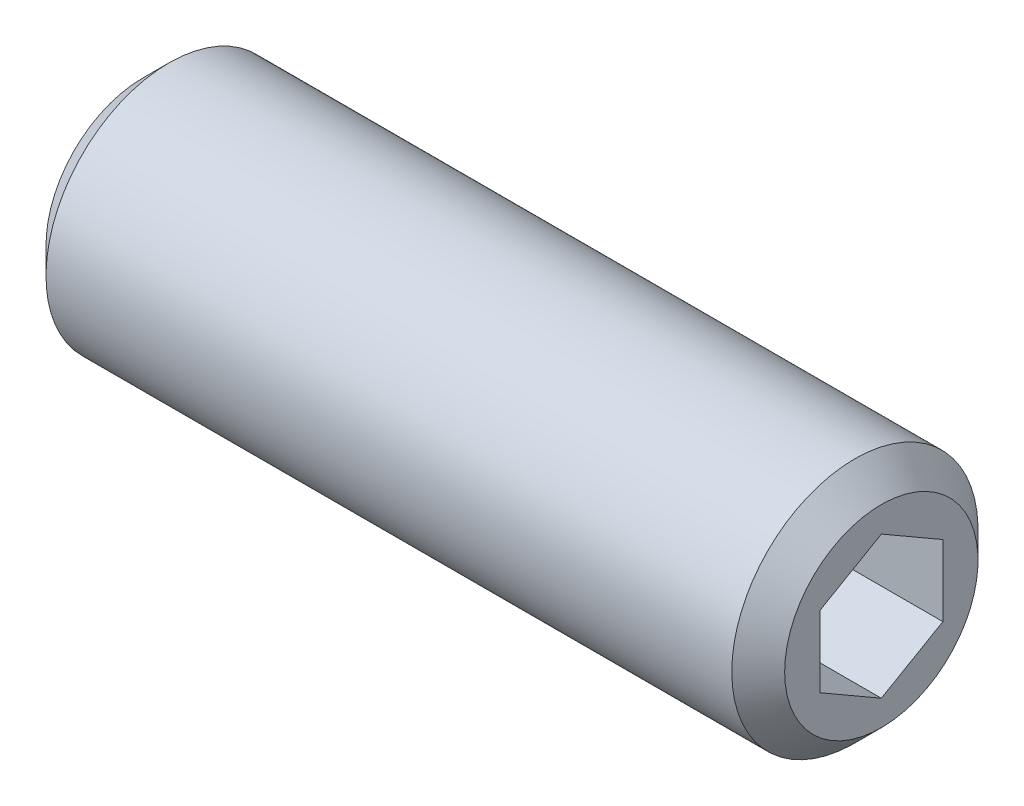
ISO-10303-21;
HEADER;
FILE_DESCRIPTION(('STEP AP214'),'2;1');
FILE_NAME('part.step','',(''),(''),'','','');
FILE_SCHEMA(('AUTOMOTIVE_DESIGN { 1 0 10303 214 1 1 1 1 }'));
ENDSEC;
DATA;
#1=APPLICATION_CONTEXT('core data for automotive mechanical design processes');
#2=APPLICATION_PROTOCOL_DEFINITION('international standard','automotive_design',2000,#1);
#3=PRODUCT_CONTEXT('',#1,'mechanical');
#4=PRODUCT('Part','Part','',(#3));
#5=PRODUCT_RELATED_PRODUCT_CATEGORY('part','',(#4));
#6=PRODUCT_DEFINITION_FORMATION('','',#4);
#7=PRODUCT_DEFINITION_CONTEXT('part definition',#1,'design');
#8=PRODUCT_DEFINITION('design','',#6,#7);
#9=PRODUCT_DEFINITION_SHAPE('','',#8);
#10=(LENGTH_UNIT() NAMED_UNIT(*) SI_UNIT(.MILLI.,.METRE.));
#11=(NAMED_UNIT(*) PLANE_ANGLE_UNIT() SI_UNIT($,.RADIAN.));
#12=(NAMED_UNIT(*) SI_UNIT($,.STERADIAN.) SOLID_ANGLE_UNIT());
#13=UNCERTAINTY_MEASURE_WITH_UNIT(LENGTH_MEASURE(1.E-05),#10,'distance_accuracy_value','');
#14=(GEOMETRIC_REPRESENTATION_CONTEXT(3) GLOBAL_UNCERTAINTY_ASSIGNED_CONTEXT((#13)) GLOBAL_UNIT_ASSIGNED_CONTEXT((#10,
#11,#12)) REPRESENTATION_CONTEXT('',''));
#15=CARTESIAN_POINT('',(0.,0.,0.));
#16=DIRECTION('',(0.,0.,1.));
#17=DIRECTION('',(1.,0.,0.));
#18=AXIS2_PLACEMENT_3D('',#15,#16,#17);
#19=CARTESIAN_POINT('',(12.,-0.577350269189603,-1.00000000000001));
#20=DIRECTION('',(0.,0.,-1.));
#21=DIRECTION('',(-1.,0.,0.));
#22=AXIS2_PLACEMENT_3D('',#19,#20,#21);
#23=PLANE('',#22);
#24=DIRECTION('',(1.,0.,0.));
#25=VECTOR('',#24,1.);
#26=CARTESIAN_POINT('',(12.,-0.577350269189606,-1.00000000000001));
#27=LINE('',#26,#25);
#28=CARTESIAN_POINT('',(9.50000000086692,-0.577350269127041,-0.999999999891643));
#29=VERTEX_POINT('',#28);
#30=CARTESIAN_POINT('',(12.,-0.577350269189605,-1.00000000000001));
#31=VERTEX_POINT('',#30);
#32=EDGE_CURVE('E76',#29,#31,#27,.T.);
#33=ORIENTED_EDGE('',*,*,#32,.T.);
#34=DIRECTION('',(0.,1.,0.));
#35=VECTOR('',#34,1.);
#36=CARTESIAN_POINT('',(12.,-0.577350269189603,-1.00000000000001));
#37=LINE('',#36,#35);
#38=CARTESIAN_POINT('',(12.,0.577350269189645,-0.999999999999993));
#39=VERTEX_POINT('',#38);
#40=EDGE_CURVE('E82',#39,#31,#37,.F.);
#41=ORIENTED_EDGE('',*,*,#40,.F.);
#42=DIRECTION('',(1.,0.,0.));
#43=VECTOR('',#42,1.);
#44=CARTESIAN_POINT('',(12.,0.577350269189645,-0.999999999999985));
#45=LINE('',#44,#43);
#46=CARTESIAN_POINT('',(9.50000000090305,0.577350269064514,-0.999999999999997));
#47=VERTEX_POINT('',#46);
#48=EDGE_CURVE('E79',#39,#47,#45,.F.);
#49=ORIENTED_EDGE('',*,*,#48,.T.);
#50=CARTESIAN_POINT('',(9.50000000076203,-0.577350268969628,-1.00000000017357));
#51=CARTESIAN_POINT('',(9.4853477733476,-0.526608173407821,-1.00000000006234));
#52=CARTESIAN_POINT('',(9.47202233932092,-0.475428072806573,-1.00000000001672));
#53=CARTESIAN_POINT('',(9.4487631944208,-0.372181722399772,-0.999999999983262));
#54=CARTESIAN_POINT('',(9.43883771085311,-0.320113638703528,-0.999999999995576));
#55=CARTESIAN_POINT('',(9.42338798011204,-0.216622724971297,-1.00000000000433));
#56=CARTESIAN_POINT('',(9.41776089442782,-0.165215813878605,-1.00000000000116));
#57=CARTESIAN_POINT('',(9.41104458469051,-0.0621602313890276,-0.999999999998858));
#58=CARTESIAN_POINT('',(9.40994979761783,-0.0105119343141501,-0.999999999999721));
#59=CARTESIAN_POINT('',(9.41223314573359,0.0859873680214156,-1.00000000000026));
#60=CARTESIAN_POINT('',(9.41505064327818,0.130852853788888,-1.00000000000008));
#61=CARTESIAN_POINT('',(9.42397865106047,0.22029154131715,-0.999999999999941));
#62=CARTESIAN_POINT('',(9.43009220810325,0.264864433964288,-0.99999999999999));
#63=CARTESIAN_POINT('',(9.44537491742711,0.354487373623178,-1.00000000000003));
#64=CARTESIAN_POINT('',(9.45460882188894,0.399526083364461,-1.00000000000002));
#65=CARTESIAN_POINT('',(9.47556588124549,0.488931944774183,-0.999999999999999));
#66=CARTESIAN_POINT('',(9.48728411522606,0.533300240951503,-0.999999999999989));
#67=CARTESIAN_POINT('',(9.5000000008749,0.577350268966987,-1.00000000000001));
#68=B_SPLINE_CURVE_WITH_KNOTS('',3,(#50,#51,#52,#53,#54,#55,#56,#57,#58,#59,#60,#61,#62,#63,#64,
#65,#66,#67),.UNSPECIFIED.,.F.,.F.,(4,2,2,2,2,2,2,2,4),(0.,0.158508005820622,0.317396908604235,
0.472353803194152,0.627120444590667,0.761853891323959,0.896712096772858,1.03456081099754,
1.17213898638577),.UNSPECIFIED.);
#69=EDGE_CURVE('E20',#29,#47,#68,.T.);
#70=ORIENTED_EDGE('',*,*,#69,.F.);
#71=EDGE_LOOP('',(#33,#41,#49,#70));
#72=FACE_BOUND('',#71,.T.);
#73=ADVANCED_FACE('F16',(#72),#23,.F.);
#74=CARTESIAN_POINT('',(12.,-1.15470053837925,0.));
#75=DIRECTION('',(0.,-0.866025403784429,-0.500000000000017));
#76=DIRECTION('',(0.,0.500000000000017,-0.866025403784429));
#77=AXIS2_PLACEMENT_3D('',#74,#75,#76);
#78=PLANE('',#77);
#79=DIRECTION('',(1.,0.,0.));
#80=VECTOR('',#79,1.);
#81=CARTESIAN_POINT('',(12.,-1.15470053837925,0.));
#82=LINE('',#81,#80);
#83=CARTESIAN_POINT('',(9.50000000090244,-1.15470053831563,-1.1020165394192E-10));
#84=VERTEX_POINT('',#83);
#85=CARTESIAN_POINT('',(12.,-1.15470053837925,0.));
#86=VERTEX_POINT('',#85);
#87=EDGE_CURVE('E146',#84,#86,#82,.T.);
#88=ORIENTED_EDGE('',*,*,#87,.T.);
#89=DIRECTION('',(0.,0.500000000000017,-0.866025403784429));
#90=VECTOR('',#89,1.);
#91=CARTESIAN_POINT('',(12.,-1.15470053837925,0.));
#92=LINE('',#91,#90);
#93=EDGE_CURVE('E92',#31,#86,#92,.F.);
#94=ORIENTED_EDGE('',*,*,#93,.F.);
#95=ORIENTED_EDGE('',*,*,#32,.F.);
#96=CARTESIAN_POINT('',(9.5000000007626,-1.15470053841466,-2.79912118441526E-10));
#97=CARTESIAN_POINT('',(9.48534777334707,-1.12932949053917,-0.0439439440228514));
#98=CARTESIAN_POINT('',(9.47202233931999,-1.10373944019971,-0.088267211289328));
#99=CARTESIAN_POINT('',(9.44876319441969,-1.05211626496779,-0.177681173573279));
#100=CARTESIAN_POINT('',(9.43883771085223,-1.02608222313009,-0.222773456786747));
#101=CARTESIAN_POINT('',(9.42338798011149,-0.974336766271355,-0.312399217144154));
#102=CARTESIAN_POINT('',(9.41776089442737,-0.948633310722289,-0.356918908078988));
#103=CARTESIAN_POINT('',(9.41104458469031,-0.897105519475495,-0.446167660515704));
#104=CARTESIAN_POINT('',(9.40994979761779,-0.871281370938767,-0.490896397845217));
#105=CARTESIAN_POINT('',(9.41223314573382,-0.823031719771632,-0.574467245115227));
#106=CARTESIAN_POINT('',(9.4150506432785,-0.800598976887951,-0.613321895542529));
#107=CARTESIAN_POINT('',(9.42397865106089,-0.755879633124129,-0.690778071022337));
#108=CARTESIAN_POINT('',(9.43009220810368,-0.733593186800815,-0.729379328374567));
#109=CARTESIAN_POINT('',(9.4453749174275,-0.688781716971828,-0.806995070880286));
#110=CARTESIAN_POINT('',(9.45460882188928,-0.66626236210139,-0.845999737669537));
#111=CARTESIAN_POINT('',(9.47556588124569,-0.621559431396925,-0.923427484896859));
#112=CARTESIAN_POINT('',(9.48728411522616,-0.599375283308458,-0.961851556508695));
#113=CARTESIAN_POINT('',(9.50000000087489,-0.577350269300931,-0.999999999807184));
#114=B_SPLINE_CURVE_WITH_KNOTS('',3,(#96,#97,#98,#99,#100,#101,#102,#103,#104,#105,#106,#107,
#108,#109,#110,#111,#112,#113),.UNSPECIFIED.,.F.,.F.,(4,2,2,2,2,2,2,2,4),(0.,0.158508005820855,
0.317396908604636,0.472353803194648,0.627120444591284,0.761853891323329,0.896712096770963,
1.03456081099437,1.17213898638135),.UNSPECIFIED.);
#115=EDGE_CURVE('E84',#84,#29,#114,.T.);
#116=ORIENTED_EDGE('',*,*,#115,.F.);
#117=EDGE_LOOP('',(#88,#94,#95,#116));
#118=FACE_BOUND('',#117,.T.);
#119=ADVANCED_FACE('F93',(#118),#78,.F.);
#120=CARTESIAN_POINT('',(12.,0.577350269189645,-0.999999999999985));
#121=DIRECTION('',(0.,0.866025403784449,-0.499999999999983));
#122=DIRECTION('',(0.,0.499999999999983,0.866025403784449));
#123=AXIS2_PLACEMENT_3D('',#120,#121,#122);
#124=PLANE('',#123);
#125=ORIENTED_EDGE('',*,*,#48,.F.);
#126=DIRECTION('',(0.,0.499999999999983,0.866025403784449));
#127=VECTOR('',#126,1.);
#128=CARTESIAN_POINT('',(12.,0.577350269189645,-0.999999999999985));
#129=LINE('',#128,#127);
#130=CARTESIAN_POINT('',(12.,1.15470053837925,0.));
#131=VERTEX_POINT('',#130);
#132=EDGE_CURVE('E91',#131,#39,#129,.F.);
#133=ORIENTED_EDGE('',*,*,#132,.F.);
#134=DIRECTION('',(1.,0.,0.));
#135=VECTOR('',#134,1.);
#136=CARTESIAN_POINT('',(12.,1.15470053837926,0.));
#137=LINE('',#136,#135);
#138=CARTESIAN_POINT('',(9.50000000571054,1.15470054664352,1.43141434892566E-08));
#139=VERTEX_POINT('',#138);
#140=EDGE_CURVE('E202',#131,#139,#137,.F.);
#141=ORIENTED_EDGE('',*,*,#140,.T.);
#142=CARTESIAN_POINT('',(9.50000000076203,0.577350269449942,-0.99999999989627));
#143=CARTESIAN_POINT('',(9.48534777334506,0.60272131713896,-0.956056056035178));
#144=CARTESIAN_POINT('',(9.47202233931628,0.628311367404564,-0.911732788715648));
#145=CARTESIAN_POINT('',(9.44876319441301,0.679934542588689,-0.8223188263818));
#146=CARTESIAN_POINT('',(9.43883771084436,0.705968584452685,-0.777226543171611));
#147=CARTESIAN_POINT('',(9.42338798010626,0.757714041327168,-0.687600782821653));
#148=CARTESIAN_POINT('',(9.41776089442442,0.78341749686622,-0.643081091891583));
#149=CARTESIAN_POINT('',(9.41104458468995,0.834945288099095,-0.55383233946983));
#150=CARTESIAN_POINT('',(9.40994979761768,0.860769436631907,-0.509103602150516));
#151=CARTESIAN_POINT('',(9.41223314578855,0.909019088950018,-0.425532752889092));
#152=CARTESIAN_POINT('',(9.41505064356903,0.93145183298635,-0.386678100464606));
#153=CARTESIAN_POINT('',(9.42397865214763,0.976171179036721,-0.309221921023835));
#154=CARTESIAN_POINT('',(9.4300922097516,0.998457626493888,-0.270620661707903));
#155=CARTESIAN_POINT('',(9.44537492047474,1.04326909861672,-0.193004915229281));
#156=CARTESIAN_POINT('',(9.45460882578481,1.06578845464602,-0.154000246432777));
#157=CARTESIAN_POINT('',(9.47556588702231,1.11049138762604,-0.0765724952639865));
#158=CARTESIAN_POINT('',(9.48728412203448,1.13267553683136,-0.0381484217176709));
#159=CARTESIAN_POINT('',(9.50000000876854,1.15470055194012,2.34881422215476E-08));
#160=B_SPLINE_CURVE_WITH_KNOTS('',3,(#142,#143,#144,#145,#146,#147,#148,#149,#150,#151,#152,
#153,#154,#155,#156,#157,#158,#159),.UNSPECIFIED.,.F.,.F.,(4,2,2,2,2,2,2,2,4),(0.,
0.158508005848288,0.31739690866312,0.472353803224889,0.627120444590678,0.76185389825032,
0.896712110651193,1.03456083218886,1.17213901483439),.UNSPECIFIED.);
#161=EDGE_CURVE('E141',#47,#139,#160,.T.);
#162=ORIENTED_EDGE('',*,*,#161,.F.);
#163=EDGE_LOOP('',(#125,#133,#141,#162));
#164=FACE_BOUND('',#163,.T.);
#165=ADVANCED_FACE('F147',(#164),#124,.F.);
#166=CARTESIAN_POINT('',(12.,-0.577350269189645,0.999999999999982));
#167=DIRECTION('',(0.,-0.866025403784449,0.499999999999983));
#168=DIRECTION('',(0.,-0.499999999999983,-0.866025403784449));
#169=AXIS2_PLACEMENT_3D('',#166,#167,#168);
#170=PLANE('',#169);
#171=DIRECTION('',(1.,0.,0.));
#172=VECTOR('',#171,1.);
#173=CARTESIAN_POINT('',(12.,-0.577350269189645,1.00000000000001));
#174=LINE('',#173,#172);
#175=CARTESIAN_POINT('',(9.49999999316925,-0.577350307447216,0.999999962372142));
#176=VERTEX_POINT('',#175);
#177=CARTESIAN_POINT('',(12.,-0.577350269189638,1.00000000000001));
#178=VERTEX_POINT('',#177);
#179=EDGE_CURVE('E199',#176,#178,#174,.T.);
#180=ORIENTED_EDGE('',*,*,#179,.T.);
#181=DIRECTION('',(0.,-0.499999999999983,-0.866025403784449));
#182=VECTOR('',#181,1.);
#183=CARTESIAN_POINT('',(12.,-0.577350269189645,0.999999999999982));
#184=LINE('',#183,#182);
#185=EDGE_CURVE('E206',#86,#178,#184,.F.);
#186=ORIENTED_EDGE('',*,*,#185,.F.);
#187=ORIENTED_EDGE('',*,*,#87,.F.);
#188=CARTESIAN_POINT('',(9.5000000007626,-1.15470053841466,2.79869271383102E-10));
#189=CARTESIAN_POINT('',(9.48534777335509,-1.12932949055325,0.0439439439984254));
#190=CARTESIAN_POINT('',(9.47202233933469,-1.10373944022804,0.0882672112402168));
#191=CARTESIAN_POINT('',(9.44876319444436,-1.05211626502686,0.177681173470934));
#192=CARTESIAN_POINT('',(9.43883771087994,-1.02608222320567,0.222773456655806));
#193=CARTESIAN_POINT('',(9.42338798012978,-0.97433676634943,0.312399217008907));
#194=CARTESIAN_POINT('',(9.41776089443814,-0.948633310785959,0.356918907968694));
#195=CARTESIAN_POINT('',(9.41104458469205,-0.897105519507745,0.446167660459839));
#196=CARTESIAN_POINT('',(9.40994979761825,-0.871281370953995,0.490896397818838));
#197=CARTESIAN_POINT('',(9.41223314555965,-0.82303172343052,0.574467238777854));
#198=CARTESIAN_POINT('',(9.41505064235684,-0.800598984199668,0.613321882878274));
#199=CARTESIAN_POINT('',(9.4239786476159,-0.755879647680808,0.690778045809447));
#200=CARTESIAN_POINT('',(9.43009220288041,-0.733593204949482,0.729379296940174));
#201=CARTESIAN_POINT('',(9.4453749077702,-0.688781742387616,0.806995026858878));
#202=CARTESIAN_POINT('',(9.4546088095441,-0.666262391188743,0.845999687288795));
#203=CARTESIAN_POINT('',(9.47556586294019,-0.621559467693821,0.923427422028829));
#204=CARTESIAN_POINT('',(9.48728409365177,-0.599375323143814,0.961851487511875));
#205=CARTESIAN_POINT('',(9.49999997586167,-0.577350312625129,0.999999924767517));
#206=B_SPLINE_CURVE_WITH_KNOTS('',3,(#188,#189,#190,#191,#192,#193,#194,#195,#196,#197,#198,
#199,#200,#201,#202,#203,#204,#205),.UNSPECIFIED.,.F.,.F.,(4,2,2,2,2,2,2,2,4),(0.,
0.158508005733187,0.317396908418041,0.472353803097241,0.627120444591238,0.761853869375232,
0.896712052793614,1.03456074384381,1.17213889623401),.UNSPECIFIED.);
#207=EDGE_CURVE('E87',#84,#176,#206,.T.);
#208=ORIENTED_EDGE('',*,*,#207,.T.);
#209=EDGE_LOOP('',(#180,#186,#187,#208));
#210=FACE_BOUND('',#209,.T.);
#211=ADVANCED_FACE('F150',(#210),#170,.F.);
#212=CARTESIAN_POINT('',(12.,1.15470053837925,0.));
#213=DIRECTION('',(0.,0.866025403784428,0.500000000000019));
#214=DIRECTION('',(0.,-0.500000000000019,0.866025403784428));
#215=AXIS2_PLACEMENT_3D('',#212,#213,#214);
#216=PLANE('',#215);
#217=ORIENTED_EDGE('',*,*,#140,.F.);
#218=DIRECTION('',(0.,-0.500000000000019,0.866025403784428));
#219=VECTOR('',#218,1.);
#220=CARTESIAN_POINT('',(12.,1.15470053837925,0.));
#221=LINE('',#220,#219);
#222=CARTESIAN_POINT('',(12.,0.577350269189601,1.00000000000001));
#223=VERTEX_POINT('',#222);
#224=EDGE_CURVE('E39',#223,#131,#221,.F.);
#225=ORIENTED_EDGE('',*,*,#224,.F.);
#226=DIRECTION('',(1.,0.,0.));
#227=VECTOR('',#226,1.);
#228=CARTESIAN_POINT('',(12.,0.577350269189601,1.00000000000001));
#229=LINE('',#228,#227);
#230=CARTESIAN_POINT('',(9.4999999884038,0.577350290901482,0.999999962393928));
#231=VERTEX_POINT('',#230);
#232=EDGE_CURVE('E113',#223,#231,#229,.F.);
#233=ORIENTED_EDGE('',*,*,#232,.T.);
#234=CARTESIAN_POINT('',(9.49999997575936,0.577350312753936,0.999999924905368));
#235=CARTESIAN_POINT('',(9.48534775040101,0.602721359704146,0.956055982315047));
#236=CARTESIAN_POINT('',(9.47202231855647,0.628311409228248,0.911732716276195));
#237=CARTESIAN_POINT('',(9.44876317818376,0.6799345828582,0.822318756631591));
#238=CARTESIAN_POINT('',(9.4388376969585,0.705968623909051,0.777226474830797));
#239=CARTESIAN_POINT('',(9.42338797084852,0.757714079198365,0.68760071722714));
#240=CARTESIAN_POINT('',(9.41776088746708,0.783417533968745,0.6430810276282));
#241=CARTESIAN_POINT('',(9.4110445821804,0.834945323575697,0.553832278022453));
#242=CARTESIAN_POINT('',(9.40994979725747,0.86076947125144,0.509103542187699));
#243=CARTESIAN_POINT('',(9.41223314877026,0.90901911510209,0.425532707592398));
#244=CARTESIAN_POINT('',(9.41505064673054,0.931451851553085,0.386678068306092));
#245=CARTESIAN_POINT('',(9.42397865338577,0.976171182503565,0.309221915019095));
#246=CARTESIAN_POINT('',(9.43009220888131,0.998457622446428,0.270620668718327));
#247=CARTESIAN_POINT('',(9.44537491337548,1.04326907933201,0.193004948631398));
#248=CARTESIAN_POINT('',(9.45460881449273,1.06578842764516,0.154000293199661));
#249=CARTESIAN_POINT('',(9.47556586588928,1.1104913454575,0.0765725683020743));
#250=CARTESIAN_POINT('',(9.48728409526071,1.13267548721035,0.0381485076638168));
#251=CARTESIAN_POINT('',(9.49999997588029,1.15470049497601,7.51766459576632E-08));
#252=B_SPLINE_CURVE_WITH_KNOTS('',3,(#234,#235,#236,#237,#238,#239,#240,#241,#242,#243,#244,
#245,#246,#247,#248,#249,#250,#251),.UNSPECIFIED.,.F.,.F.,(4,2,2,2,2,2,2,2,4),(0.,
0.158507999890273,0.317396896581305,0.47235378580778,0.627120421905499,0.761853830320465,
0.896711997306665,1.03456067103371,1.17213880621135),.UNSPECIFIED.);
#253=EDGE_CURVE('E137',#231,#139,#252,.T.);
#254=ORIENTED_EDGE('',*,*,#253,.T.);
#255=EDGE_LOOP('',(#217,#225,#233,#254));
#256=FACE_BOUND('',#255,.T.);
#257=ADVANCED_FACE('F125',(#256),#216,.F.);
#258=CARTESIAN_POINT('',(9.50400000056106,0.,0.));
#259=DIRECTION('',(1.,0.,0.));
#260=DIRECTION('',(0.,0.,-1.));
#261=AXIS2_PLACEMENT_3D('',#258,#259,#260);
#262=CONICAL_SURFACE('',#261,1.16162874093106,1.04719754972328);
#263=CARTESIAN_POINT('',(8.83333333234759,-1.70530256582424E-10,0.));
#264=VERTEX_POINT('',#263);
#265=VERTEX_LOOP('',#264);
#266=FACE_BOUND('',#265,.T.);
#267=ORIENTED_EDGE('',*,*,#207,.F.);
#268=ORIENTED_EDGE('',*,*,#115,.T.);
#269=ORIENTED_EDGE('',*,*,#69,.T.);
#270=ORIENTED_EDGE('',*,*,#161,.T.);
#271=ORIENTED_EDGE('',*,*,#253,.F.);
#272=CARTESIAN_POINT('',(9.50000003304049,0.577350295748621,0.999999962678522));
#273=CARTESIAN_POINT('',(9.48534778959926,0.526608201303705,0.999999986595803));
#274=CARTESIAN_POINT('',(9.47202234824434,0.475428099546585,0.999999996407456));
#275=CARTESIAN_POINT('',(9.44876319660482,0.372181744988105,1.00000000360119));
#276=CARTESIAN_POINT('',(9.43883771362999,0.320113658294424,1.00000000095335));
#277=CARTESIAN_POINT('',(9.42338798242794,0.216622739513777,0.999999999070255));
#278=CARTESIAN_POINT('',(9.41776089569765,0.165215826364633,0.999999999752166));
#279=CARTESIAN_POINT('',(9.41104458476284,0.0621602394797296,1.00000000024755));
#280=CARTESIAN_POINT('',(9.40994979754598,0.0105119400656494,1.00000000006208));
#281=CARTESIAN_POINT('',(9.41223314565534,-0.085987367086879,0.999999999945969));
#282=CARTESIAN_POINT('',(9.41505064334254,-0.130852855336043,0.999999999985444));
#283=CARTESIAN_POINT('',(9.42397865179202,-0.220291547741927,1.00000000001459));
#284=CARTESIAN_POINT('',(9.43009220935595,-0.264864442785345,1.00000000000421));
#285=CARTESIAN_POINT('',(9.44537492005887,-0.35448738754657,0.999999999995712));
#286=CARTESIAN_POINT('',(9.45460882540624,-0.399526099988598,0.999999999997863));
#287=CARTESIAN_POINT('',(9.4755658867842,-0.488931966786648,1.00000000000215));
#288=CARTESIAN_POINT('',(9.48728412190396,-0.533300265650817,1.00000000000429));
#289=CARTESIAN_POINT('',(9.5000000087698,-0.577350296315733,1.00000000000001));
#290=B_SPLINE_CURVE_WITH_KNOTS('',3,(#272,#273,#274,#275,#276,#277,#278,#279,#280,#281,#282,
#283,#284,#285,#286,#287,#288,#289),.UNSPECIFIED.,.F.,.F.,(4,2,2,2,2,2,2,2,4),(0.,
0.158508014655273,0.317396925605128,0.472353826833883,0.627120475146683,0.761853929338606,
0.896712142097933,1.03456086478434,1.17213904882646),.UNSPECIFIED.);
#291=EDGE_CURVE('E107',#231,#176,#290,.T.);
#292=ORIENTED_EDGE('',*,*,#291,.T.);
#293=EDGE_LOOP('',(#267,#268,#269,#270,#271,#292));
#294=FACE_BOUND('',#293,.T.);
#295=ADVANCED_FACE('F85',(#266,#294),#262,.F.);
#296=CARTESIAN_POINT('',(12.,0.577350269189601,1.00000000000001));
#297=DIRECTION('',(0.,0.,1.));
#298=DIRECTION('',(1.,0.,0.));
#299=AXIS2_PLACEMENT_3D('',#296,#297,#298);
#300=PLANE('',#299);
#301=ORIENTED_EDGE('',*,*,#232,.F.);
#302=DIRECTION('',(0.,1.,0.));
#303=VECTOR('',#302,1.);
#304=CARTESIAN_POINT('',(12.,0.,1.00000000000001));
#305=LINE('',#304,#303);
#306=EDGE_CURVE('E106',#223,#178,#305,.F.);
#307=ORIENTED_EDGE('',*,*,#306,.T.);
#308=ORIENTED_EDGE('',*,*,#179,.F.);
#309=ORIENTED_EDGE('',*,*,#291,.F.);
#310=EDGE_LOOP('',(#301,#307,#308,#309));
#311=FACE_BOUND('',#310,.T.);
#312=ADVANCED_FACE('F119',(#311),#300,.F.);
#313=CARTESIAN_POINT('',(12.,0.,0.));
#314=DIRECTION('',(-1.,0.,0.));
#315=DIRECTION('',(0.,0.,1.));
#316=AXIS2_PLACEMENT_3D('',#313,#314,#315);
#317=PLANE('',#316);
#318=ORIENTED_EDGE('',*,*,#224,.T.);
#319=ORIENTED_EDGE('',*,*,#132,.T.);
#320=ORIENTED_EDGE('',*,*,#40,.T.);
#321=ORIENTED_EDGE('',*,*,#93,.T.);
#322=ORIENTED_EDGE('',*,*,#185,.T.);
#323=ORIENTED_EDGE('',*,*,#306,.F.);
#324=EDGE_LOOP('',(#318,#319,#320,#321,#322,#323));
#325=FACE_BOUND('',#324,.T.);
#326=CARTESIAN_POINT('',(12.0000000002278,0.,0.));
#327=DIRECTION('',(-1.,0.,0.));
#328=DIRECTION('',(0.,0.,1.));
#329=AXIS2_PLACEMENT_3D('',#326,#327,#328);
#330=CIRCLE('',#329,1.57058500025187);
#331=CARTESIAN_POINT('',(12.0000000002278,0.,1.57058500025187));
#332=VERTEX_POINT('',#331);
#333=EDGE_CURVE('E103',#332,#332,#330,.T.);
#334=ORIENTED_EDGE('',*,*,#333,.F.);
#335=EDGE_LOOP('',(#334));
#336=FACE_BOUND('',#335,.T.);
#337=ADVANCED_FACE('F177',(#325,#336),#317,.F.);
#338=CARTESIAN_POINT('',(0.,0.999999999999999,0.));
#339=DIRECTION('',(-1.,0.,0.));
#340=DIRECTION('',(0.,0.,1.));
#341=AXIS2_PLACEMENT_3D('',#338,#339,#340);
#342=PLANE('',#341);
#343=CARTESIAN_POINT('',(-2.27373783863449E-10,0.,0.));
#344=DIRECTION('',(1.,0.,0.));
#345=DIRECTION('',(0.,1.,0.));
#346=AXIS2_PLACEMENT_3D('',#343,#344,#345);
#347=CIRCLE('',#346,1.57058500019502);
#348=CARTESIAN_POINT('',(-2.27373847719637E-10,1.57058500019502,0.));
#349=VERTEX_POINT('',#348);
#350=EDGE_CURVE('E100',#349,#349,#347,.T.);
#351=ORIENTED_EDGE('',*,*,#350,.F.);
#352=EDGE_LOOP('',(#351));
#353=FACE_BOUND('',#352,.T.);
#354=ADVANCED_FACE('F174',(#353),#342,.T.);
#355=CARTESIAN_POINT('',(11.5705849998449,0.,0.));
#356=DIRECTION('',(-1.,0.,0.));
#357=DIRECTION('',(0.,0.,1.));
#358=AXIS2_PLACEMENT_3D('',#355,#356,#357);
#359=CONICAL_SURFACE('',#358,1.99999999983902,0.78539816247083);
#360=ORIENTED_EDGE('',*,*,#333,.T.);
#361=EDGE_LOOP('',(#360));
#362=FACE_BOUND('',#361,.T.);
#363=CARTESIAN_POINT('',(11.570585,0.,0.));
#364=DIRECTION('',(1.,0.,0.));
#365=DIRECTION('',(0.,1.,0.));
#366=AXIS2_PLACEMENT_3D('',#363,#364,#365);
#367=CIRCLE('',#366,2.);
#368=CARTESIAN_POINT('',(11.570585,2.,0.));
#369=VERTEX_POINT('',#368);
#370=EDGE_CURVE('E30',#369,#369,#367,.F.);
#371=ORIENTED_EDGE('',*,*,#370,.F.);
#372=EDGE_LOOP('',(#371));
#373=FACE_BOUND('',#372,.T.);
#374=ADVANCED_FACE('F167',(#362,#373),#359,.T.);
#375=CARTESIAN_POINT('',(0.429415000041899,0.,0.));
#376=DIRECTION('',(1.,0.,0.));
#377=DIRECTION('',(0.,1.,0.));
#378=AXIS2_PLACEMENT_3D('',#375,#376,#377);
#379=CONICAL_SURFACE('',#378,1.99999999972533,0.785398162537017);
#380=CARTESIAN_POINT('',(0.429415,0.,0.));
#381=DIRECTION('',(1.,0.,0.));
#382=DIRECTION('',(0.,1.,0.));
#383=AXIS2_PLACEMENT_3D('',#380,#381,#382);
#384=CIRCLE('',#383,2.);
#385=CARTESIAN_POINT('',(0.429415,2.,0.));
#386=VERTEX_POINT('',#385);
#387=EDGE_CURVE('E11',#386,#386,#384,.T.);
#388=ORIENTED_EDGE('',*,*,#387,.F.);
#389=EDGE_LOOP('',(#388));
#390=FACE_BOUND('',#389,.T.);
#391=ORIENTED_EDGE('',*,*,#350,.T.);
#392=EDGE_LOOP('',(#391));
#393=FACE_BOUND('',#392,.T.);
#394=ADVANCED_FACE('F161',(#390,#393),#379,.T.);
#395=CARTESIAN_POINT('',(6.,0.,0.));
#396=DIRECTION('',(1.,0.,0.));
#397=DIRECTION('',(0.,1.,0.));
#398=AXIS2_PLACEMENT_3D('',#395,#396,#397);
#399=CYLINDRICAL_SURFACE('',#398,2.);
#400=ORIENTED_EDGE('',*,*,#387,.T.);
#401=EDGE_LOOP('',(#400));
#402=FACE_BOUND('',#401,.T.);
#403=ORIENTED_EDGE('',*,*,#370,.T.);
#404=EDGE_LOOP('',(#403));
#405=FACE_BOUND('',#404,.T.);
#406=ADVANCED_FACE('F159',(#402,#405),#399,.T.);
#407=CLOSED_SHELL('',(#73,#119,#165,#211,#257,#295,#312,#337,#354,#374,#394,#406));
#408=MANIFOLD_SOLID_BREP('B1',#407);
#409=ADVANCED_BREP_SHAPE_REPRESENTATION('',(#18,#408),#14);
#410=SHAPE_DEFINITION_REPRESENTATION(#9,#409);
ENDSEC;
END-ISO-10303-21;
